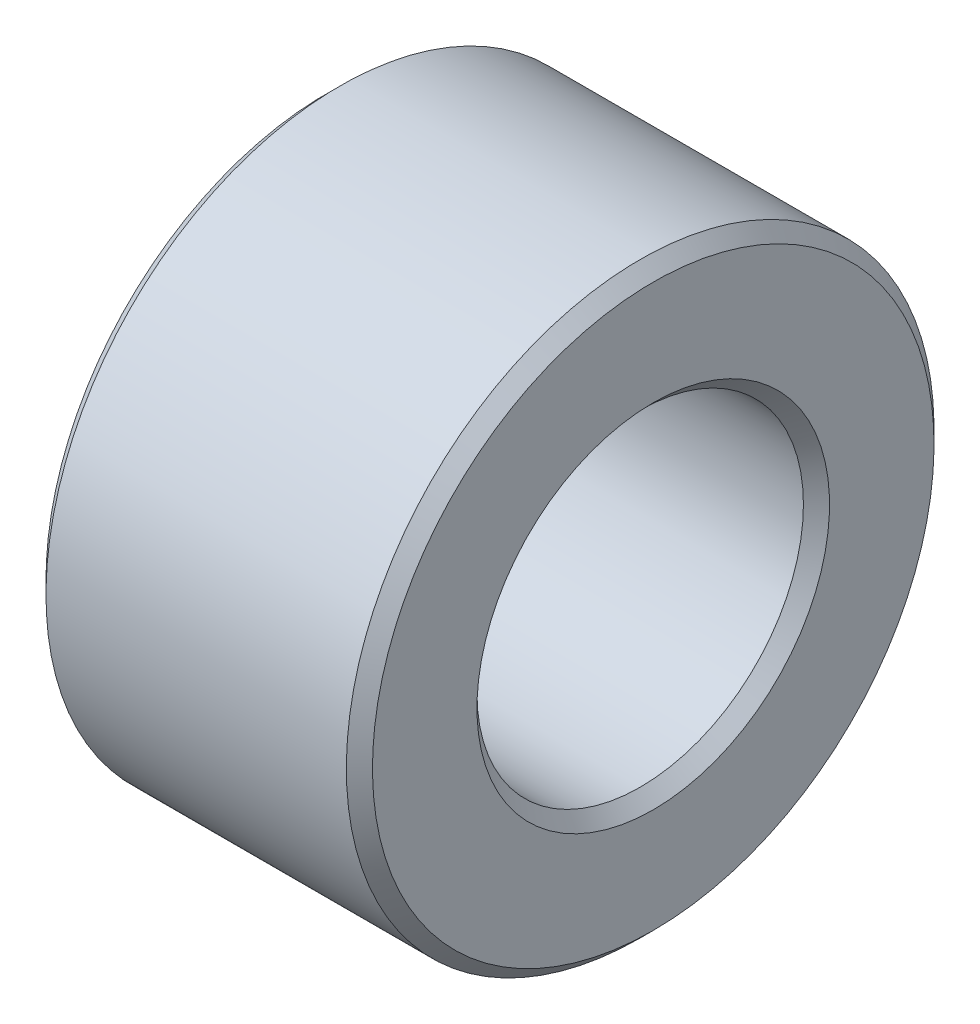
ISO-10303-21;
HEADER;
FILE_DESCRIPTION(('STEP AP214'),'2;1');
FILE_NAME('part.step','',(''),(''),'','','');
FILE_SCHEMA(('AUTOMOTIVE_DESIGN { 1 0 10303 214 1 1 1 1 }'));
ENDSEC;
DATA;
#1=APPLICATION_CONTEXT('core data for automotive mechanical design processes');
#2=APPLICATION_PROTOCOL_DEFINITION('international standard','automotive_design',2000,#1);
#3=PRODUCT_CONTEXT('',#1,'mechanical');
#4=PRODUCT('Part','Part','',(#3));
#5=PRODUCT_RELATED_PRODUCT_CATEGORY('part','',(#4));
#6=PRODUCT_DEFINITION_FORMATION('','',#4);
#7=PRODUCT_DEFINITION_CONTEXT('part definition',#1,'design');
#8=PRODUCT_DEFINITION('design','',#6,#7);
#9=PRODUCT_DEFINITION_SHAPE('','',#8);
#10=(LENGTH_UNIT() NAMED_UNIT(*) SI_UNIT(.MILLI.,.METRE.));
#11=(NAMED_UNIT(*) PLANE_ANGLE_UNIT() SI_UNIT($,.RADIAN.));
#12=(NAMED_UNIT(*) SI_UNIT($,.STERADIAN.) SOLID_ANGLE_UNIT());
#13=UNCERTAINTY_MEASURE_WITH_UNIT(LENGTH_MEASURE(1.E-05),#10,'distance_accuracy_value','');
#14=(GEOMETRIC_REPRESENTATION_CONTEXT(3) GLOBAL_UNCERTAINTY_ASSIGNED_CONTEXT((#13)) GLOBAL_UNIT_ASSIGNED_CONTEXT((#10,
#11,#12)) REPRESENTATION_CONTEXT('',''));
#15=CARTESIAN_POINT('',(0.,0.,0.));
#16=DIRECTION('',(0.,0.,1.));
#17=DIRECTION('',(1.,0.,0.));
#18=AXIS2_PLACEMENT_3D('',#15,#16,#17);
#19=CARTESIAN_POINT('',(0.,-7.,0.));
#20=DIRECTION('',(-1.,0.,0.));
#21=DIRECTION('',(0.,1.,0.));
#22=AXIS2_PLACEMENT_3D('',#19,#20,#21);
#23=PLANE('',#22);
#24=CARTESIAN_POINT('',(0.,0.,0.));
#25=DIRECTION('',(1.,0.,0.));
#26=DIRECTION('',(0.,-1.,0.));
#27=AXIS2_PLACEMENT_3D('',#24,#25,#26);
#28=CIRCLE('',#27,5.4);
#29=CARTESIAN_POINT('',(0.,-5.4,0.));
#30=VERTEX_POINT('',#29);
#31=EDGE_CURVE('E9',#30,#30,#28,.T.);
#32=ORIENTED_EDGE('',*,*,#31,.T.);
#33=EDGE_LOOP('',(#32));
#34=FACE_BOUND('',#33,.T.);
#35=CARTESIAN_POINT('',(0.,0.,0.));
#36=DIRECTION('',(1.,0.,0.));
#37=DIRECTION('',(0.,-1.,0.));
#38=AXIS2_PLACEMENT_3D('',#35,#36,#37);
#39=CIRCLE('',#38,8.6);
#40=CARTESIAN_POINT('',(0.,-8.6,0.));
#41=VERTEX_POINT('',#40);
#42=EDGE_CURVE('E53',#41,#41,#39,.T.);
#43=ORIENTED_EDGE('',*,*,#42,.F.);
#44=EDGE_LOOP('',(#43));
#45=FACE_BOUND('',#44,.T.);
#46=ADVANCED_FACE('F15',(#34,#45),#23,.T.);
#47=CARTESIAN_POINT('',(0.2,0.,0.));
#48=DIRECTION('',(-1.,0.,0.));
#49=DIRECTION('',(0.,-1.,0.));
#50=AXIS2_PLACEMENT_3D('',#47,#48,#49);
#51=CONICAL_SURFACE('',#50,5.2,0.785398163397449);
#52=CARTESIAN_POINT('',(0.4,0.,0.));
#53=DIRECTION('',(1.,0.,0.));
#54=DIRECTION('',(0.,-1.,0.));
#55=AXIS2_PLACEMENT_3D('',#52,#53,#54);
#56=CIRCLE('',#55,5.);
#57=CARTESIAN_POINT('',(0.4,-5.,0.));
#58=VERTEX_POINT('',#57);
#59=EDGE_CURVE('E22',#58,#58,#56,.T.);
#60=ORIENTED_EDGE('',*,*,#59,.T.);
#61=EDGE_LOOP('',(#60));
#62=FACE_BOUND('',#61,.T.);
#63=ORIENTED_EDGE('',*,*,#31,.F.);
#64=EDGE_LOOP('',(#63));
#65=FACE_BOUND('',#64,.T.);
#66=ADVANCED_FACE('F82',(#62,#65),#51,.F.);
#67=CARTESIAN_POINT('',(5.,0.,0.));
#68=DIRECTION('',(-1.,0.,0.));
#69=DIRECTION('',(0.,-1.,0.));
#70=AXIS2_PLACEMENT_3D('',#67,#68,#69);
#71=CYLINDRICAL_SURFACE('',#70,5.);
#72=CARTESIAN_POINT('',(9.6,0.,0.));
#73=DIRECTION('',(1.,0.,0.));
#74=DIRECTION('',(0.,-1.,0.));
#75=AXIS2_PLACEMENT_3D('',#72,#73,#74);
#76=CIRCLE('',#75,5.);
#77=CARTESIAN_POINT('',(9.6,-5.,0.));
#78=VERTEX_POINT('',#77);
#79=EDGE_CURVE('E58',#78,#78,#76,.T.);
#80=ORIENTED_EDGE('',*,*,#79,.T.);
#81=EDGE_LOOP('',(#80));
#82=FACE_BOUND('',#81,.T.);
#83=ORIENTED_EDGE('',*,*,#59,.F.);
#84=EDGE_LOOP('',(#83));
#85=FACE_BOUND('',#84,.T.);
#86=ADVANCED_FACE('F66',(#82,#85),#71,.F.);
#87=CARTESIAN_POINT('',(9.8,0.,0.));
#88=DIRECTION('',(1.,0.,0.));
#89=DIRECTION('',(0.,-1.,0.));
#90=AXIS2_PLACEMENT_3D('',#87,#88,#89);
#91=CONICAL_SURFACE('',#90,5.2,0.785398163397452);
#92=CARTESIAN_POINT('',(10.,0.,0.));
#93=DIRECTION('',(1.,0.,0.));
#94=DIRECTION('',(0.,-1.,0.));
#95=AXIS2_PLACEMENT_3D('',#92,#93,#94);
#96=CIRCLE('',#95,5.4);
#97=CARTESIAN_POINT('',(10.,-5.4,0.));
#98=VERTEX_POINT('',#97);
#99=EDGE_CURVE('E63',#98,#98,#96,.T.);
#100=ORIENTED_EDGE('',*,*,#99,.T.);
#101=EDGE_LOOP('',(#100));
#102=FACE_BOUND('',#101,.T.);
#103=ORIENTED_EDGE('',*,*,#79,.F.);
#104=EDGE_LOOP('',(#103));
#105=FACE_BOUND('',#104,.T.);
#106=ADVANCED_FACE('F69',(#102,#105),#91,.F.);
#107=CARTESIAN_POINT('',(10.,-7.,0.));
#108=DIRECTION('',(1.,0.,0.));
#109=DIRECTION('',(0.,-1.,0.));
#110=AXIS2_PLACEMENT_3D('',#107,#108,#109);
#111=PLANE('',#110);
#112=CARTESIAN_POINT('',(10.,0.,0.));
#113=DIRECTION('',(1.,0.,0.));
#114=DIRECTION('',(0.,-1.,0.));
#115=AXIS2_PLACEMENT_3D('',#112,#113,#114);
#116=CIRCLE('',#115,8.6);
#117=CARTESIAN_POINT('',(10.,-8.6,0.));
#118=VERTEX_POINT('',#117);
#119=EDGE_CURVE('E61',#118,#118,#116,.T.);
#120=ORIENTED_EDGE('',*,*,#119,.T.);
#121=EDGE_LOOP('',(#120));
#122=FACE_BOUND('',#121,.T.);
#123=ORIENTED_EDGE('',*,*,#99,.F.);
#124=EDGE_LOOP('',(#123));
#125=FACE_BOUND('',#124,.T.);
#126=ADVANCED_FACE('F71',(#122,#125),#111,.T.);
#127=CARTESIAN_POINT('',(9.8,0.,0.));
#128=DIRECTION('',(-1.,0.,0.));
#129=DIRECTION('',(0.,-1.,0.));
#130=AXIS2_PLACEMENT_3D('',#127,#128,#129);
#131=CONICAL_SURFACE('',#130,8.8,0.785398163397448);
#132=CARTESIAN_POINT('',(9.6,0.,0.));
#133=DIRECTION('',(1.,0.,0.));
#134=DIRECTION('',(0.,-1.,0.));
#135=AXIS2_PLACEMENT_3D('',#132,#133,#134);
#136=CIRCLE('',#135,9.);
#137=CARTESIAN_POINT('',(9.6,-9.,0.));
#138=VERTEX_POINT('',#137);
#139=EDGE_CURVE('E55',#138,#138,#136,.T.);
#140=ORIENTED_EDGE('',*,*,#139,.T.);
#141=EDGE_LOOP('',(#140));
#142=FACE_BOUND('',#141,.T.);
#143=ORIENTED_EDGE('',*,*,#119,.F.);
#144=EDGE_LOOP('',(#143));
#145=FACE_BOUND('',#144,.T.);
#146=ADVANCED_FACE('F79',(#142,#145),#131,.T.);
#147=CARTESIAN_POINT('',(5.,0.,0.));
#148=DIRECTION('',(-1.,0.,0.));
#149=DIRECTION('',(0.,-1.,0.));
#150=AXIS2_PLACEMENT_3D('',#147,#148,#149);
#151=CYLINDRICAL_SURFACE('',#150,9.);
#152=CARTESIAN_POINT('',(0.4,0.,0.));
#153=DIRECTION('',(1.,0.,0.));
#154=DIRECTION('',(0.,-1.,0.));
#155=AXIS2_PLACEMENT_3D('',#152,#153,#154);
#156=CIRCLE('',#155,9.);
#157=CARTESIAN_POINT('',(0.4,-9.,0.));
#158=VERTEX_POINT('',#157);
#159=EDGE_CURVE('E49',#158,#158,#156,.T.);
#160=ORIENTED_EDGE('',*,*,#159,.T.);
#161=EDGE_LOOP('',(#160));
#162=FACE_BOUND('',#161,.T.);
#163=ORIENTED_EDGE('',*,*,#139,.F.);
#164=EDGE_LOOP('',(#163));
#165=FACE_BOUND('',#164,.T.);
#166=ADVANCED_FACE('F50',(#162,#165),#151,.T.);
#167=CARTESIAN_POINT('',(0.2,0.,0.));
#168=DIRECTION('',(1.,0.,0.));
#169=DIRECTION('',(0.,-1.,0.));
#170=AXIS2_PLACEMENT_3D('',#167,#168,#169);
#171=CONICAL_SURFACE('',#170,8.8,0.785398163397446);
#172=ORIENTED_EDGE('',*,*,#42,.T.);
#173=EDGE_LOOP('',(#172));
#174=FACE_BOUND('',#173,.T.);
#175=ORIENTED_EDGE('',*,*,#159,.F.);
#176=EDGE_LOOP('',(#175));
#177=FACE_BOUND('',#176,.T.);
#178=ADVANCED_FACE('F92',(#174,#177),#171,.T.);
#179=CLOSED_SHELL('',(#46,#66,#86,#106,#126,#146,#166,#178));
#180=MANIFOLD_SOLID_BREP('B1',#179);
#181=ADVANCED_BREP_SHAPE_REPRESENTATION('',(#18,#180),#14);
#182=SHAPE_DEFINITION_REPRESENTATION(#9,#181);
ENDSEC;
END-ISO-10303-21;
